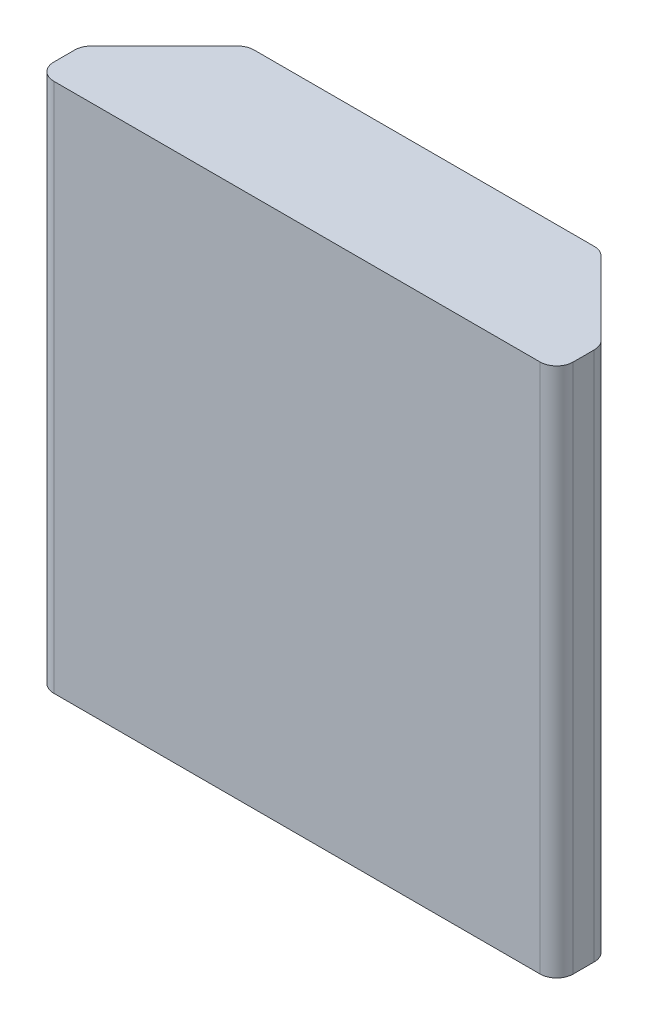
ISO-10303-21;
HEADER;
FILE_DESCRIPTION(('STEP AP214'),'2;1');
FILE_NAME('part.step','',(''),(''),'','','');
FILE_SCHEMA(('AUTOMOTIVE_DESIGN { 1 0 10303 214 1 1 1 1 }'));
ENDSEC;
DATA;
#1=APPLICATION_CONTEXT('core data for automotive mechanical design processes');
#2=APPLICATION_PROTOCOL_DEFINITION('international standard','automotive_design',2000,#1);
#3=PRODUCT_CONTEXT('',#1,'mechanical');
#4=PRODUCT('Part','Part','',(#3));
#5=PRODUCT_RELATED_PRODUCT_CATEGORY('part','',(#4));
#6=PRODUCT_DEFINITION_FORMATION('','',#4);
#7=PRODUCT_DEFINITION_CONTEXT('part definition',#1,'design');
#8=PRODUCT_DEFINITION('design','',#6,#7);
#9=PRODUCT_DEFINITION_SHAPE('','',#8);
#10=(LENGTH_UNIT() NAMED_UNIT(*) SI_UNIT(.MILLI.,.METRE.));
#11=(NAMED_UNIT(*) PLANE_ANGLE_UNIT() SI_UNIT($,.RADIAN.));
#12=(NAMED_UNIT(*) SI_UNIT($,.STERADIAN.) SOLID_ANGLE_UNIT());
#13=UNCERTAINTY_MEASURE_WITH_UNIT(LENGTH_MEASURE(1.E-05),#10,'distance_accuracy_value','');
#14=(GEOMETRIC_REPRESENTATION_CONTEXT(3) GLOBAL_UNCERTAINTY_ASSIGNED_CONTEXT((#13)) GLOBAL_UNIT_ASSIGNED_CONTEXT((#10,
#11,#12)) REPRESENTATION_CONTEXT('',''));
#15=CARTESIAN_POINT('',(0.,0.,0.));
#16=DIRECTION('',(0.,0.,1.));
#17=DIRECTION('',(1.,0.,0.));
#18=AXIS2_PLACEMENT_3D('',#15,#16,#17);
#19=CARTESIAN_POINT('',(5.826125,12.7,-0.899233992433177));
#20=DIRECTION('',(0.,-1.,0.));
#21=DIRECTION('',(0.,0.,-1.));
#22=AXIS2_PLACEMENT_3D('',#19,#20,#21);
#23=CYLINDRICAL_SURFACE('',#22,0.396875);
#24=CARTESIAN_POINT('',(5.826125,0.,-0.899233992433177));
#25=DIRECTION('',(0.,1.,0.));
#26=DIRECTION('',(0.,0.,-1.));
#27=AXIS2_PLACEMENT_3D('',#24,#25,#26);
#28=CIRCLE('',#27,0.396875);
#29=CARTESIAN_POINT('',(6.223,0.,-0.899233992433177));
#30=VERTEX_POINT('',#29);
#31=CARTESIAN_POINT('',(6.10675800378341,0.,-1.17986699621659));
#32=VERTEX_POINT('',#31);
#33=EDGE_CURVE('E152',#30,#32,#28,.T.);
#34=ORIENTED_EDGE('',*,*,#33,.T.);
#35=DIRECTION('',(0.,-1.,0.));
#36=VECTOR('',#35,1.);
#37=CARTESIAN_POINT('',(6.10675800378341,12.7,-1.17986699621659));
#38=LINE('',#37,#36);
#39=CARTESIAN_POINT('',(6.10675800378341,12.7,-1.17986699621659));
#40=VERTEX_POINT('',#39);
#41=EDGE_CURVE('E11',#40,#32,#38,.T.);
#42=ORIENTED_EDGE('',*,*,#41,.F.);
#43=CARTESIAN_POINT('',(5.826125,12.7,-0.899233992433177));
#44=DIRECTION('',(0.,1.,0.));
#45=DIRECTION('',(0.,0.,-1.));
#46=AXIS2_PLACEMENT_3D('',#43,#44,#45);
#47=CIRCLE('',#46,0.396875);
#48=CARTESIAN_POINT('',(6.223,12.7,-0.899233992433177));
#49=VERTEX_POINT('',#48);
#50=EDGE_CURVE('E174',#49,#40,#47,.T.);
#51=ORIENTED_EDGE('',*,*,#50,.F.);
#52=DIRECTION('',(0.,-1.,0.));
#53=VECTOR('',#52,1.);
#54=CARTESIAN_POINT('',(6.223,12.7,-0.899233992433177));
#55=LINE('',#54,#53);
#56=EDGE_CURVE('E148',#49,#30,#55,.T.);
#57=ORIENTED_EDGE('',*,*,#56,.T.);
#58=EDGE_LOOP('',(#34,#42,#51,#57));
#59=FACE_BOUND('',#58,.T.);
#60=ADVANCED_FACE('F32',(#59),#23,.T.);
#61=CARTESIAN_POINT('',(4.35486699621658,12.7,-2.93175800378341));
#62=DIRECTION('',(-0.707106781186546,0.,0.707106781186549));
#63=DIRECTION('',(0.707106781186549,0.,0.707106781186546));
#64=AXIS2_PLACEMENT_3D('',#61,#62,#63);
#65=PLANE('',#64);
#66=DIRECTION('',(-0.707106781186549,0.,-0.707106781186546));
#67=VECTOR('',#66,1.);
#68=CARTESIAN_POINT('',(4.35486699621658,0.,-2.93175800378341));
#69=LINE('',#68,#67);
#70=CARTESIAN_POINT('',(4.35486699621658,0.,-2.93175800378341));
#71=VERTEX_POINT('',#70);
#72=EDGE_CURVE('E155',#32,#71,#69,.T.);
#73=ORIENTED_EDGE('',*,*,#72,.T.);
#74=DIRECTION('',(0.,-1.,0.));
#75=VECTOR('',#74,1.);
#76=CARTESIAN_POINT('',(4.35486699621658,12.7,-2.93175800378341));
#77=LINE('',#76,#75);
#78=CARTESIAN_POINT('',(4.35486699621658,12.7,-2.93175800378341));
#79=VERTEX_POINT('',#78);
#80=EDGE_CURVE('E40',#79,#71,#77,.T.);
#81=ORIENTED_EDGE('',*,*,#80,.F.);
#82=DIRECTION('',(-0.707106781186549,0.,-0.707106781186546));
#83=VECTOR('',#82,1.);
#84=CARTESIAN_POINT('',(4.35486699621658,12.7,-2.93175800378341));
#85=LINE('',#84,#83);
#86=EDGE_CURVE('E103',#40,#79,#85,.T.);
#87=ORIENTED_EDGE('',*,*,#86,.F.);
#88=ORIENTED_EDGE('',*,*,#41,.T.);
#89=EDGE_LOOP('',(#73,#81,#87,#88));
#90=FACE_BOUND('',#89,.T.);
#91=ADVANCED_FACE('F252',(#90),#65,.F.);
#92=CARTESIAN_POINT('',(4.07423399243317,12.7,-2.651125));
#93=DIRECTION('',(0.,-1.,0.));
#94=DIRECTION('',(0.,0.,-1.));
#95=AXIS2_PLACEMENT_3D('',#92,#93,#94);
#96=CYLINDRICAL_SURFACE('',#95,0.396875);
#97=CARTESIAN_POINT('',(4.07423399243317,0.,-2.651125));
#98=DIRECTION('',(0.,1.,0.));
#99=DIRECTION('',(0.,0.,1.));
#100=AXIS2_PLACEMENT_3D('',#97,#98,#99);
#101=CIRCLE('',#100,0.396875);
#102=CARTESIAN_POINT('',(4.07423399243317,0.,-3.048));
#103=VERTEX_POINT('',#102);
#104=EDGE_CURVE('E157',#71,#103,#101,.T.);
#105=ORIENTED_EDGE('',*,*,#104,.T.);
#106=DIRECTION('',(0.,-1.,0.));
#107=VECTOR('',#106,1.);
#108=CARTESIAN_POINT('',(4.07423399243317,12.7,-3.048));
#109=LINE('',#108,#107);
#110=CARTESIAN_POINT('',(4.07423399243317,12.7,-3.048));
#111=VERTEX_POINT('',#110);
#112=EDGE_CURVE('E193',#111,#103,#109,.T.);
#113=ORIENTED_EDGE('',*,*,#112,.F.);
#114=CARTESIAN_POINT('',(4.07423399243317,12.7,-2.651125));
#115=DIRECTION('',(0.,1.,0.));
#116=DIRECTION('',(0.,0.,1.));
#117=AXIS2_PLACEMENT_3D('',#114,#115,#116);
#118=CIRCLE('',#117,0.396875);
#119=EDGE_CURVE('E201',#79,#111,#118,.T.);
#120=ORIENTED_EDGE('',*,*,#119,.F.);
#121=ORIENTED_EDGE('',*,*,#80,.T.);
#122=EDGE_LOOP('',(#105,#113,#120,#121));
#123=FACE_BOUND('',#122,.T.);
#124=ADVANCED_FACE('F199',(#123),#96,.T.);
#125=CARTESIAN_POINT('',(-4.07423399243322,12.7,-3.048));
#126=DIRECTION('',(0.,0.,1.));
#127=DIRECTION('',(1.,0.,0.));
#128=AXIS2_PLACEMENT_3D('',#125,#126,#127);
#129=PLANE('',#128);
#130=DIRECTION('',(-1.,0.,0.));
#131=VECTOR('',#130,1.);
#132=CARTESIAN_POINT('',(-4.07423399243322,0.,-3.048));
#133=LINE('',#132,#131);
#134=CARTESIAN_POINT('',(-4.07423399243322,0.,-3.048));
#135=VERTEX_POINT('',#134);
#136=EDGE_CURVE('E159',#103,#135,#133,.T.);
#137=ORIENTED_EDGE('',*,*,#136,.T.);
#138=DIRECTION('',(0.,-1.,0.));
#139=VECTOR('',#138,1.);
#140=CARTESIAN_POINT('',(-4.07423399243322,12.7,-3.048));
#141=LINE('',#140,#139);
#142=CARTESIAN_POINT('',(-4.07423399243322,12.7,-3.048));
#143=VERTEX_POINT('',#142);
#144=EDGE_CURVE('E190',#143,#135,#141,.T.);
#145=ORIENTED_EDGE('',*,*,#144,.F.);
#146=DIRECTION('',(-1.,0.,0.));
#147=VECTOR('',#146,1.);
#148=CARTESIAN_POINT('',(-4.07423399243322,12.7,-3.048));
#149=LINE('',#148,#147);
#150=EDGE_CURVE('E219',#111,#143,#149,.T.);
#151=ORIENTED_EDGE('',*,*,#150,.F.);
#152=ORIENTED_EDGE('',*,*,#112,.T.);
#153=EDGE_LOOP('',(#137,#145,#151,#152));
#154=FACE_BOUND('',#153,.T.);
#155=ADVANCED_FACE('F210',(#154),#129,.F.);
#156=CARTESIAN_POINT('',(-4.07423399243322,12.7,-2.651125));
#157=DIRECTION('',(0.,-1.,0.));
#158=DIRECTION('',(0.,0.,-1.));
#159=AXIS2_PLACEMENT_3D('',#156,#157,#158);
#160=CYLINDRICAL_SURFACE('',#159,0.396875);
#161=CARTESIAN_POINT('',(-4.07423399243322,0.,-2.651125));
#162=DIRECTION('',(0.,1.,0.));
#163=DIRECTION('',(0.,0.,1.));
#164=AXIS2_PLACEMENT_3D('',#161,#162,#163);
#165=CIRCLE('',#164,0.396875);
#166=CARTESIAN_POINT('',(-4.35486699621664,0.,-2.93175800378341));
#167=VERTEX_POINT('',#166);
#168=EDGE_CURVE('E161',#135,#167,#165,.T.);
#169=ORIENTED_EDGE('',*,*,#168,.T.);
#170=DIRECTION('',(0.,-1.,0.));
#171=VECTOR('',#170,1.);
#172=CARTESIAN_POINT('',(-4.35486699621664,12.7,-2.93175800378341));
#173=LINE('',#172,#171);
#174=CARTESIAN_POINT('',(-4.35486699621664,12.7,-2.93175800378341));
#175=VERTEX_POINT('',#174);
#176=EDGE_CURVE('E187',#175,#167,#173,.T.);
#177=ORIENTED_EDGE('',*,*,#176,.F.);
#178=CARTESIAN_POINT('',(-4.07423399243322,12.7,-2.651125));
#179=DIRECTION('',(0.,1.,0.));
#180=DIRECTION('',(0.,0.,1.));
#181=AXIS2_PLACEMENT_3D('',#178,#179,#180);
#182=CIRCLE('',#181,0.396875);
#183=EDGE_CURVE('E216',#143,#175,#182,.T.);
#184=ORIENTED_EDGE('',*,*,#183,.F.);
#185=ORIENTED_EDGE('',*,*,#144,.T.);
#186=EDGE_LOOP('',(#169,#177,#184,#185));
#187=FACE_BOUND('',#186,.T.);
#188=ADVANCED_FACE('F214',(#187),#160,.T.);
#189=CARTESIAN_POINT('',(-6.10675800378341,12.7,-1.17986699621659));
#190=DIRECTION('',(0.707106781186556,0.,0.707106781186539));
#191=DIRECTION('',(0.707106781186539,0.,-0.707106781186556));
#192=AXIS2_PLACEMENT_3D('',#189,#190,#191);
#193=PLANE('',#192);
#194=DIRECTION('',(-0.707106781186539,0.,0.707106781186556));
#195=VECTOR('',#194,1.);
#196=CARTESIAN_POINT('',(-6.10675800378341,0.,-1.17986699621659));
#197=LINE('',#196,#195);
#198=CARTESIAN_POINT('',(-6.10675800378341,0.,-1.17986699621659));
#199=VERTEX_POINT('',#198);
#200=EDGE_CURVE('E163',#167,#199,#197,.T.);
#201=ORIENTED_EDGE('',*,*,#200,.T.);
#202=DIRECTION('',(0.,-1.,0.));
#203=VECTOR('',#202,1.);
#204=CARTESIAN_POINT('',(-6.10675800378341,12.7,-1.17986699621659));
#205=LINE('',#204,#203);
#206=CARTESIAN_POINT('',(-6.10675800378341,12.7,-1.17986699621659));
#207=VERTEX_POINT('',#206);
#208=EDGE_CURVE('E184',#207,#199,#205,.T.);
#209=ORIENTED_EDGE('',*,*,#208,.F.);
#210=DIRECTION('',(-0.707106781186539,0.,0.707106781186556));
#211=VECTOR('',#210,1.);
#212=CARTESIAN_POINT('',(-6.10675800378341,12.7,-1.17986699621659));
#213=LINE('',#212,#211);
#214=EDGE_CURVE('E218',#175,#207,#213,.T.);
#215=ORIENTED_EDGE('',*,*,#214,.F.);
#216=ORIENTED_EDGE('',*,*,#176,.T.);
#217=EDGE_LOOP('',(#201,#209,#215,#216));
#218=FACE_BOUND('',#217,.T.);
#219=ADVANCED_FACE('F265',(#218),#193,.F.);
#220=CARTESIAN_POINT('',(-5.826125,12.7,-0.89923399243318));
#221=DIRECTION('',(0.,-1.,0.));
#222=DIRECTION('',(0.,0.,-1.));
#223=AXIS2_PLACEMENT_3D('',#220,#221,#222);
#224=CYLINDRICAL_SURFACE('',#223,0.396875);
#225=CARTESIAN_POINT('',(-5.826125,0.,-0.89923399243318));
#226=DIRECTION('',(0.,1.,0.));
#227=DIRECTION('',(0.,0.,1.));
#228=AXIS2_PLACEMENT_3D('',#225,#226,#227);
#229=CIRCLE('',#228,0.396875);
#230=CARTESIAN_POINT('',(-6.223,0.,-0.89923399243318));
#231=VERTEX_POINT('',#230);
#232=EDGE_CURVE('E165',#199,#231,#229,.T.);
#233=ORIENTED_EDGE('',*,*,#232,.T.);
#234=DIRECTION('',(0.,-1.,0.));
#235=VECTOR('',#234,1.);
#236=CARTESIAN_POINT('',(-6.223,12.7,-0.89923399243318));
#237=LINE('',#236,#235);
#238=CARTESIAN_POINT('',(-6.223,12.7,-0.89923399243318));
#239=VERTEX_POINT('',#238);
#240=EDGE_CURVE('E181',#239,#231,#237,.T.);
#241=ORIENTED_EDGE('',*,*,#240,.F.);
#242=CARTESIAN_POINT('',(-5.826125,12.7,-0.89923399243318));
#243=DIRECTION('',(0.,1.,0.));
#244=DIRECTION('',(0.,0.,1.));
#245=AXIS2_PLACEMENT_3D('',#242,#243,#244);
#246=CIRCLE('',#245,0.396875);
#247=EDGE_CURVE('E221',#207,#239,#246,.T.);
#248=ORIENTED_EDGE('',*,*,#247,.F.);
#249=ORIENTED_EDGE('',*,*,#208,.T.);
#250=EDGE_LOOP('',(#233,#241,#248,#249));
#251=FACE_BOUND('',#250,.T.);
#252=ADVANCED_FACE('F268',(#251),#224,.T.);
#253=CARTESIAN_POINT('',(-6.223,12.7,-0.396875));
#254=DIRECTION('',(1.,0.,0.));
#255=DIRECTION('',(0.,0.,-1.));
#256=AXIS2_PLACEMENT_3D('',#253,#254,#255);
#257=PLANE('',#256);
#258=DIRECTION('',(0.,0.,1.));
#259=VECTOR('',#258,1.);
#260=CARTESIAN_POINT('',(-6.223,0.,-0.396875));
#261=LINE('',#260,#259);
#262=CARTESIAN_POINT('',(-6.223,0.,-0.396875));
#263=VERTEX_POINT('',#262);
#264=EDGE_CURVE('E167',#231,#263,#261,.T.);
#265=ORIENTED_EDGE('',*,*,#264,.T.);
#266=DIRECTION('',(0.,-1.,0.));
#267=VECTOR('',#266,1.);
#268=CARTESIAN_POINT('',(-6.223,12.7,-0.396875));
#269=LINE('',#268,#267);
#270=CARTESIAN_POINT('',(-6.223,12.7,-0.396875));
#271=VERTEX_POINT('',#270);
#272=EDGE_CURVE('E178',#271,#263,#269,.T.);
#273=ORIENTED_EDGE('',*,*,#272,.F.);
#274=DIRECTION('',(0.,0.,1.));
#275=VECTOR('',#274,1.);
#276=CARTESIAN_POINT('',(-6.223,12.7,-0.396875));
#277=LINE('',#276,#275);
#278=EDGE_CURVE('E227',#239,#271,#277,.T.);
#279=ORIENTED_EDGE('',*,*,#278,.F.);
#280=ORIENTED_EDGE('',*,*,#240,.T.);
#281=EDGE_LOOP('',(#265,#273,#279,#280));
#282=FACE_BOUND('',#281,.T.);
#283=ADVANCED_FACE('F233',(#282),#257,.F.);
#284=CARTESIAN_POINT('',(-5.826125,12.7,-0.396875));
#285=DIRECTION('',(0.,-1.,0.));
#286=DIRECTION('',(0.,0.,-1.));
#287=AXIS2_PLACEMENT_3D('',#284,#285,#286);
#288=CYLINDRICAL_SURFACE('',#287,0.396875);
#289=CARTESIAN_POINT('',(-5.826125,0.,-0.396875));
#290=DIRECTION('',(0.,1.,0.));
#291=DIRECTION('',(0.,0.,-1.));
#292=AXIS2_PLACEMENT_3D('',#289,#290,#291);
#293=CIRCLE('',#292,0.396875);
#294=CARTESIAN_POINT('',(-5.826125,0.,0.));
#295=VERTEX_POINT('',#294);
#296=EDGE_CURVE('E169',#263,#295,#293,.T.);
#297=ORIENTED_EDGE('',*,*,#296,.T.);
#298=DIRECTION('',(0.,-1.,0.));
#299=VECTOR('',#298,1.);
#300=CARTESIAN_POINT('',(-5.826125,12.7,0.));
#301=LINE('',#300,#299);
#302=CARTESIAN_POINT('',(-5.826125,12.7,0.));
#303=VERTEX_POINT('',#302);
#304=EDGE_CURVE('E143',#303,#295,#301,.T.);
#305=ORIENTED_EDGE('',*,*,#304,.F.);
#306=CARTESIAN_POINT('',(-5.826125,12.7,-0.396875));
#307=DIRECTION('',(0.,1.,0.));
#308=DIRECTION('',(0.,0.,-1.));
#309=AXIS2_PLACEMENT_3D('',#306,#307,#308);
#310=CIRCLE('',#309,0.396875);
#311=EDGE_CURVE('E134',#271,#303,#310,.T.);
#312=ORIENTED_EDGE('',*,*,#311,.F.);
#313=ORIENTED_EDGE('',*,*,#272,.T.);
#314=EDGE_LOOP('',(#297,#305,#312,#313));
#315=FACE_BOUND('',#314,.T.);
#316=ADVANCED_FACE('F237',(#315),#288,.T.);
#317=CARTESIAN_POINT('',(-5.826125,12.7,0.));
#318=DIRECTION('',(0.,0.,-1.));
#319=DIRECTION('',(-1.,0.,0.));
#320=AXIS2_PLACEMENT_3D('',#317,#318,#319);
#321=PLANE('',#320);
#322=DIRECTION('',(1.,0.,0.));
#323=VECTOR('',#322,1.);
#324=CARTESIAN_POINT('',(-5.826125,0.,0.));
#325=LINE('',#324,#323);
#326=CARTESIAN_POINT('',(5.826125,0.,0.));
#327=VERTEX_POINT('',#326);
#328=EDGE_CURVE('E142',#295,#327,#325,.T.);
#329=ORIENTED_EDGE('',*,*,#328,.T.);
#330=DIRECTION('',(0.,-1.,0.));
#331=VECTOR('',#330,1.);
#332=CARTESIAN_POINT('',(5.826125,12.7,0.));
#333=LINE('',#332,#331);
#334=CARTESIAN_POINT('',(5.826125,12.7,0.));
#335=VERTEX_POINT('',#334);
#336=EDGE_CURVE('E139',#335,#327,#333,.T.);
#337=ORIENTED_EDGE('',*,*,#336,.F.);
#338=DIRECTION('',(1.,0.,0.));
#339=VECTOR('',#338,1.);
#340=CARTESIAN_POINT('',(-5.826125,12.7,0.));
#341=LINE('',#340,#339);
#342=EDGE_CURVE('E128',#303,#335,#341,.T.);
#343=ORIENTED_EDGE('',*,*,#342,.F.);
#344=ORIENTED_EDGE('',*,*,#304,.T.);
#345=EDGE_LOOP('',(#329,#337,#343,#344));
#346=FACE_BOUND('',#345,.T.);
#347=ADVANCED_FACE('F140',(#346),#321,.F.);
#348=CARTESIAN_POINT('',(5.826125,12.7,-0.396875));
#349=DIRECTION('',(0.,-1.,0.));
#350=DIRECTION('',(0.,0.,-1.));
#351=AXIS2_PLACEMENT_3D('',#348,#349,#350);
#352=CYLINDRICAL_SURFACE('',#351,0.396875);
#353=CARTESIAN_POINT('',(5.826125,0.,-0.396875));
#354=DIRECTION('',(0.,1.,0.));
#355=DIRECTION('',(0.,0.,-1.));
#356=AXIS2_PLACEMENT_3D('',#353,#354,#355);
#357=CIRCLE('',#356,0.396875);
#358=CARTESIAN_POINT('',(6.223,0.,-0.396875));
#359=VERTEX_POINT('',#358);
#360=EDGE_CURVE('E89',#327,#359,#357,.T.);
#361=ORIENTED_EDGE('',*,*,#360,.T.);
#362=DIRECTION('',(0.,-1.,0.));
#363=VECTOR('',#362,1.);
#364=CARTESIAN_POINT('',(6.223,12.7,-0.396875));
#365=LINE('',#364,#363);
#366=CARTESIAN_POINT('',(6.223,12.7,-0.396875));
#367=VERTEX_POINT('',#366);
#368=EDGE_CURVE('E144',#367,#359,#365,.T.);
#369=ORIENTED_EDGE('',*,*,#368,.F.);
#370=CARTESIAN_POINT('',(5.826125,12.7,-0.396875));
#371=DIRECTION('',(0.,1.,0.));
#372=DIRECTION('',(0.,0.,-1.));
#373=AXIS2_PLACEMENT_3D('',#370,#371,#372);
#374=CIRCLE('',#373,0.396875);
#375=EDGE_CURVE('E132',#335,#367,#374,.T.);
#376=ORIENTED_EDGE('',*,*,#375,.F.);
#377=ORIENTED_EDGE('',*,*,#336,.T.);
#378=EDGE_LOOP('',(#361,#369,#376,#377));
#379=FACE_BOUND('',#378,.T.);
#380=ADVANCED_FACE('F146',(#379),#352,.T.);
#381=CARTESIAN_POINT('',(6.223,12.7,-0.899233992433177));
#382=DIRECTION('',(-1.,0.,0.));
#383=DIRECTION('',(0.,0.,1.));
#384=AXIS2_PLACEMENT_3D('',#381,#382,#383);
#385=PLANE('',#384);
#386=DIRECTION('',(0.,0.,-1.));
#387=VECTOR('',#386,1.);
#388=CARTESIAN_POINT('',(6.223,0.,-0.899233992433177));
#389=LINE('',#388,#387);
#390=EDGE_CURVE('E95',#359,#30,#389,.T.);
#391=ORIENTED_EDGE('',*,*,#390,.T.);
#392=ORIENTED_EDGE('',*,*,#56,.F.);
#393=DIRECTION('',(0.,0.,-1.));
#394=VECTOR('',#393,1.);
#395=CARTESIAN_POINT('',(6.223,12.7,-0.899233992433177));
#396=LINE('',#395,#394);
#397=EDGE_CURVE('E48',#367,#49,#396,.T.);
#398=ORIENTED_EDGE('',*,*,#397,.F.);
#399=ORIENTED_EDGE('',*,*,#368,.T.);
#400=EDGE_LOOP('',(#391,#392,#398,#399));
#401=FACE_BOUND('',#400,.T.);
#402=ADVANCED_FACE('F241',(#401),#385,.F.);
#403=CARTESIAN_POINT('',(5.826125,12.7,-0.899233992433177));
#404=DIRECTION('',(0.,-1.,0.));
#405=DIRECTION('',(0.,0.,-1.));
#406=AXIS2_PLACEMENT_3D('',#403,#404,#405);
#407=PLANE('',#406);
#408=ORIENTED_EDGE('',*,*,#50,.T.);
#409=ORIENTED_EDGE('',*,*,#86,.T.);
#410=ORIENTED_EDGE('',*,*,#119,.T.);
#411=ORIENTED_EDGE('',*,*,#150,.T.);
#412=ORIENTED_EDGE('',*,*,#183,.T.);
#413=ORIENTED_EDGE('',*,*,#214,.T.);
#414=ORIENTED_EDGE('',*,*,#247,.T.);
#415=ORIENTED_EDGE('',*,*,#278,.T.);
#416=ORIENTED_EDGE('',*,*,#311,.T.);
#417=ORIENTED_EDGE('',*,*,#342,.T.);
#418=ORIENTED_EDGE('',*,*,#375,.T.);
#419=ORIENTED_EDGE('',*,*,#397,.T.);
#420=EDGE_LOOP('',(#408,#409,#410,#411,#412,#413,#414,#415,#416,#417,#418,#419));
#421=FACE_BOUND('',#420,.T.);
#422=ADVANCED_FACE('F130',(#421),#407,.F.);
#423=CARTESIAN_POINT('',(5.826125,0.,-0.899233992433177));
#424=DIRECTION('',(0.,-1.,0.));
#425=DIRECTION('',(0.,0.,-1.));
#426=AXIS2_PLACEMENT_3D('',#423,#424,#425);
#427=PLANE('',#426);
#428=ORIENTED_EDGE('',*,*,#33,.F.);
#429=ORIENTED_EDGE('',*,*,#390,.F.);
#430=ORIENTED_EDGE('',*,*,#360,.F.);
#431=ORIENTED_EDGE('',*,*,#328,.F.);
#432=ORIENTED_EDGE('',*,*,#296,.F.);
#433=ORIENTED_EDGE('',*,*,#264,.F.);
#434=ORIENTED_EDGE('',*,*,#232,.F.);
#435=ORIENTED_EDGE('',*,*,#200,.F.);
#436=ORIENTED_EDGE('',*,*,#168,.F.);
#437=ORIENTED_EDGE('',*,*,#136,.F.);
#438=ORIENTED_EDGE('',*,*,#104,.F.);
#439=ORIENTED_EDGE('',*,*,#72,.F.);
#440=EDGE_LOOP('',(#428,#429,#430,#431,#432,#433,#434,#435,#436,#437,#438,#439));
#441=FACE_BOUND('',#440,.T.);
#442=ADVANCED_FACE('F205',(#441),#427,.T.);
#443=CLOSED_SHELL('',(#60,#91,#124,#155,#188,#219,#252,#283,#316,#347,#380,#402,#422,#442));
#444=MANIFOLD_SOLID_BREP('B2',#443);
#445=ADVANCED_BREP_SHAPE_REPRESENTATION('',(#18,#444),#14);
#446=SHAPE_DEFINITION_REPRESENTATION(#9,#445);
ENDSEC;
END-ISO-10303-21;
